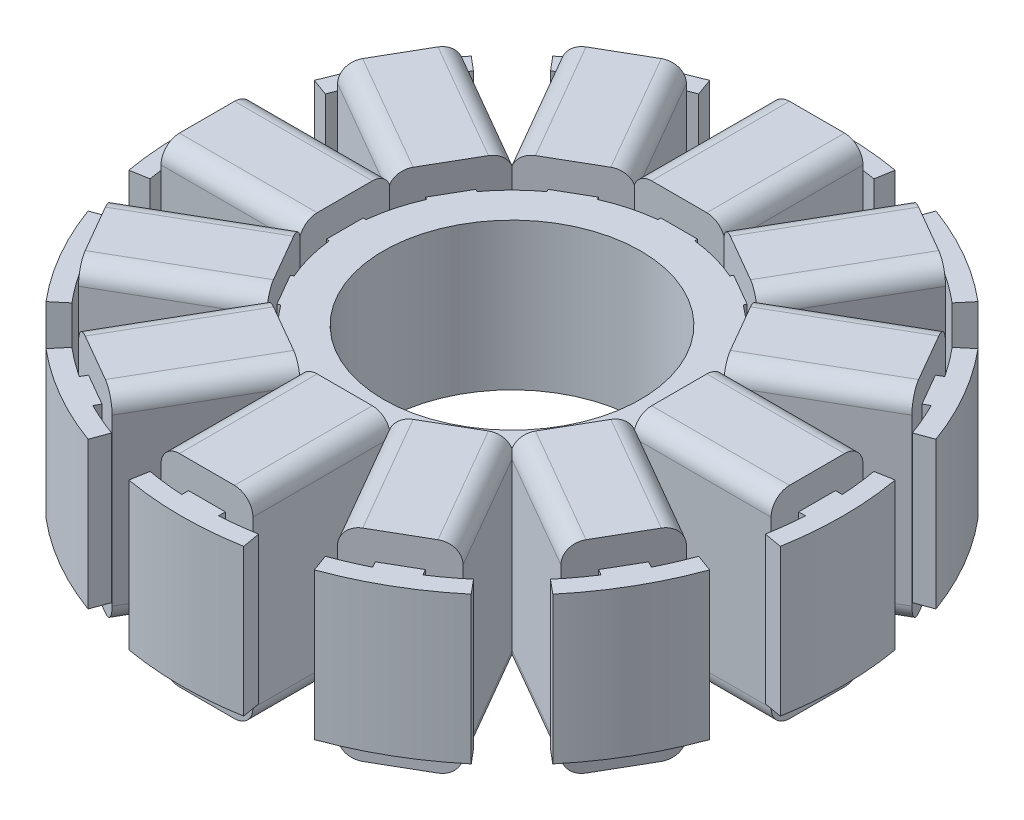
from build123d import *

# Parameters (mm, degrees)
SKETCH1_R           = 9
SKETCH1_R_2         = 7
BOSS_EXTRUDE1_DEPTH = 8
BOSS_EXTRUDE4_DEPTH = 8
BOSS_EXTRUDE5_DEPTH = 7.5
CIRPATTERN2_COUNT   = 12
CIRPATTERN3_COUNT   = 12


with BuildPart() as part:
    # Sketch1 → Boss-Extrude1 (new body)
    with BuildSketch(Plane(origin=(0, 0, 0), x_dir=(1, 0, 0), z_dir=(0, 1, 0))):
        with Locations(Location((0, 0, 0), (0, 0, 270))):
            Circle(SKETCH1_R)
        with Locations(Location((0, 0, 0), (0, 0, 270))):
            Circle(SKETCH1_R_2, mode=Mode.SUBTRACT)
    extrude(amount=BOSS_EXTRUDE1_DEPTH)

    # Sketch1_3 → Boss-Extrude4 (add)
    with BuildSketch(Plane(origin=(0, 0, 0), x_dir=(1, 0, 0), z_dir=(0, 1, 0))):
        with BuildLine():
            Line((-1, 16.970562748), (-1, 8.94427191))
            ThreePointArc((-1, 8.94427191), (0, 9), (1, 8.94427191))
            Line((1, 8.94427191), (1, 16.970562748))
            ThreePointArc((1, 16.970562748), (1.979319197, 16.884380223), (2.95201902, 16.741731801))
            Line((2.95201902, 16.741731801), (3.125667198, 17.726539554))
            ThreePointArc((3.125667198, 17.726539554), (0, 18), (-3.125667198, 17.726539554))
            Line((-3.125667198, 17.726539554), (-2.95201902, 16.741731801))
            ThreePointArc((-2.95201902, 16.741731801), (-1.979319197, 16.884380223), (-1, 16.970562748))
        make_face()
    boss_extrude4 = extrude(amount=BOSS_EXTRUDE4_DEPTH)

    # Sketch2 → Boss-Extrude5 (add)
    with BuildSketch(Plane.XY.offset(-9.1)):
        with BuildLine():
            Line((-2.5, 8.5), (-2.5, -0.5))
            ThreePointArc((-2.5, -0.5), (-2.207106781, -1.207106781), (-1.5, -1.5))
            Line((-1.5, -1.5), (1.5, -1.5))
            ThreePointArc((1.5, -1.5), (2.207106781, -1.207106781), (2.5, -0.5))
            Line((2.5, -0.5), (2.5, 8.5))
            ThreePointArc((2.5, 8.5), (2.207106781, 9.207106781), (1.5, 9.5))
            Line((1.5, 9.5), (-1.5, 9.5))
            ThreePointArc((-1.5, 9.5), (-2.207106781, 9.207106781), (-2.5, 8.5))
        make_face()
    boss_extrude5 = extrude(amount=-BOSS_EXTRUDE5_DEPTH)

    # CirPattern2: Boss-Extrude4 ×12 about axis
    cirpattern2_axis = Axis((0, 0, 0), (0, 1, 0))
    for i in range(1, CIRPATTERN2_COUNT):
        add(boss_extrude4.rotate(cirpattern2_axis, i * 360 / CIRPATTERN2_COUNT))

    # CirPattern3: Boss-Extrude5 ×12 about axis
    cirpattern3_axis = Axis((0, 0, 0), (0, 1, 0))
    for i in range(1, CIRPATTERN3_COUNT):
        add(boss_extrude5.rotate(cirpattern3_axis, i * 360 / CIRPATTERN3_COUNT))


solid = part.part
